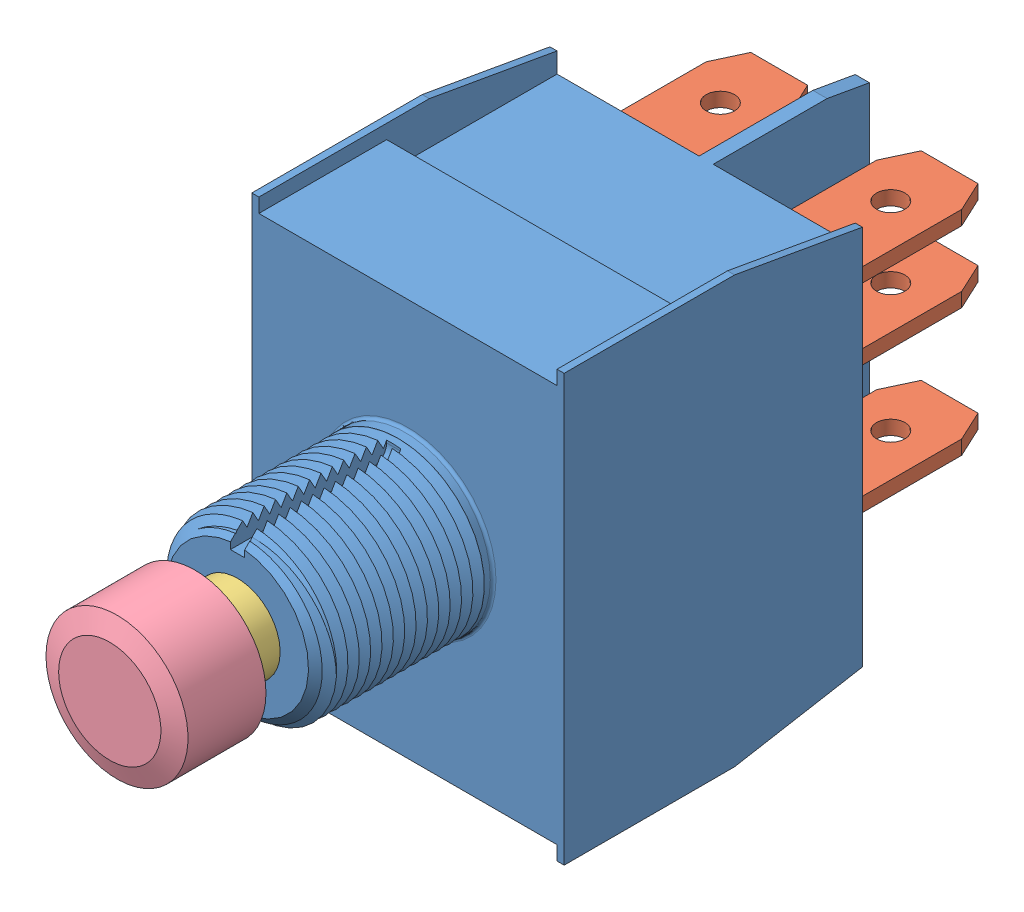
SolidWorks assembly PoussoirDD.SLDASM, configuration Défaut (file format 7000). Lengths in mm.
Overall size (22 30 53.14).
9 component instances, 4 part files, 22 mates.
Components (placement in the parent):
- PoussoirDD1-1: PoussoirDD1.SLDPRT [Défaut] at (0.8553 -0.3305 22.0048) size (22 30 44.01)
- PoussoirDD2-1: PoussoirDD2.SLDPRT [Défaut] at (-9.1447 8.6695 32.0048) x (1 0 0) z (0 -1 0) size (8 17.4 1)
- PoussoirDD2-2: PoussoirDD2.SLDPRT [Défaut] at (2.8553 8.6695 32.0048) x (1 0 0) z (0 -1 0) size (8 17.4 1)
- PoussoirDD2-3: PoussoirDD2.SLDPRT [Défaut] at (-9.1447 3.6695 32.0048) x (1 0 0) z (0 -1 0) size (8 17.4 1)
- PoussoirDD2-4: PoussoirDD2.SLDPRT [Défaut] at (2.8553 -5.3305 32.0048) x (1 0 0) z (0 -1 0) size (8 17.4 1)
- PoussoirDD2-5: PoussoirDD2.SLDPRT [Défaut] at (-9.1447 -5.3305 32.0048) x (1 0 0) z (0 -1 0) size (8 17.4 1)
- PoussoirDD2-6: PoussoirDD2.SLDPRT [Défaut] at (2.8553 3.6695 32.0048) x (1 0 0) z (0 -1 0) size (8 17.4 1)
- PoussoirDD6-1: PoussoirDD6.SLDPRT [Défaut] at (0.8553 -0.3305 74.0048) x (0 0 -1) z (0.736163 0.676805 0) size (20 6 6)
- PoussoirDD3-1: PoussoirDD3.SLDPRT [Défaut] at (0.8553 -0.3305 75.0048) x (0 0 -1) z (1 0 0) size (6 10 10)
Mates (geometry in assembly coordinates):
- Coïncidente1: coincident anti-aligned: plane of PoussoirDD1-1 through (-2.1447 8.6695 38.0048) normal (0 -1 0); plane of PoussoirDD2-1 through (-9.1447 8.6695 32.0048) normal (0 1 0)
- Coïncidente2: coincident anti-aligned: plane of PoussoirDD1-1 through (-2.1447 3.6695 38.0048) normal (0 -1 0); plane of PoussoirDD2-3 through (-9.1447 3.6695 32.0048) normal (0 1 0)
- Coïncidente3: coincident anti-aligned: plane of PoussoirDD1-1 through (-2.1447 -5.3305 38.0048) normal (0 -1 0); plane of PoussoirDD2-5 through (-9.1447 -5.3305 32.0048) normal (0 1 0)
- Coïncidente4: coincident anti-aligned: plane of PoussoirDD1-1 through (9.8553 8.6695 38.0048) normal (0 -1 0); plane of PoussoirDD2-2 through (2.8553 8.6695 32.0048) normal (0 1 0)
- Coïncidente5: coincident anti-aligned: plane of PoussoirDD1-1 through (9.8553 3.6695 38.0048) normal (0 -1 0); plane of PoussoirDD2-6 through (2.8553 3.6695 32.0048) normal (0 1 0)
- Coïncidente6: coincident anti-aligned: plane of PoussoirDD1-1 through (9.8553 -5.3305 38.0048) normal (0 -1 0); plane of PoussoirDD2-4 through (2.8553 -5.3305 32.0048) normal (0 1 0)
- Coïncidente7: coincident anti-aligned: plane of PoussoirDD1-1 through (-8.1447 -5.3305 38.0048) normal (1 0 0); plane of PoussoirDD2-5 through (-8.1447 -6.3305 33.0048) normal (-1 0 0)
- Coïncidente8: coincident anti-aligned: plane of PoussoirDD1-1 through (-2.1447 3.6695 38.0048) normal (-1 0 0); plane of PoussoirDD2-3 through (-2.1447 2.6695 39.2595) normal (1 0 0)
- Coïncidente9: coincident anti-aligned: plane of PoussoirDD1-1 through (-2.1447 8.6695 38.0048) normal (-1 0 0); plane of PoussoirDD2-1 through (-2.1447 7.6695 39.2595) normal (1 0 0)
- Coïncidente10: coincident anti-aligned: plane of PoussoirDD1-1 through (3.8553 -5.3305 38.0048) normal (1 0 0); plane of PoussoirDD2-4 through (3.8553 -6.3305 33.0048) normal (-1 0 0)
- Coïncidente11: coincident anti-aligned: plane of PoussoirDD1-1 through (3.8553 3.6695 38.0048) normal (1 0 0); plane of PoussoirDD2-6 through (3.8553 2.6695 33.0048) normal (-1 0 0)
- Coïncidente12: coincident anti-aligned: plane of PoussoirDD1-1 through (3.8553 8.6695 38.0048) normal (1 0 0); plane of PoussoirDD2-2 through (3.8553 7.6695 33.0048) normal (-1 0 0)
- Coïncidente13: coincident anti-aligned: plane of PoussoirDD1-1 through (0.8553 -0.3305 33.0048) normal (0 0 -1); plane of PoussoirDD2-1 through (-9.1447 7.6695 33.0048) normal (0 0 1)
- Coïncidente14: coincident anti-aligned: plane of PoussoirDD1-1 through (0.8553 -0.3305 33.0048) normal (0 0 -1); plane of PoussoirDD2-3 through (-9.1447 2.6695 33.0048) normal (0 0 1)
- Coïncidente15: coincident anti-aligned: plane of PoussoirDD1-1 through (0.8553 -0.3305 33.0048) normal (0 0 -1); plane of PoussoirDD2-5 through (-9.1447 -6.3305 33.0048) normal (0 0 1)
- Coïncidente16: coincident anti-aligned: plane of PoussoirDD1-1 through (0.8553 -0.3305 33.0048) normal (0 0 -1); plane of PoussoirDD2-4 through (9.8553 -6.3305 33.0048) normal (0 0 1)
- Coïncidente17: coincident anti-aligned: plane of PoussoirDD1-1 through (0.8553 -0.3305 33.0048) normal (0 0 -1); plane of PoussoirDD2-6 through (9.8553 2.6695 33.0048) normal (0 0 1)
- Coïncidente18: coincident anti-aligned: plane of PoussoirDD1-1 through (0.8553 -0.3305 33.0048) normal (0 0 -1); plane of PoussoirDD2-2 through (9.8553 7.6695 33.0048) normal (0 0 1)
- Coaxiale2: concentric anti-aligned: cylinder of PoussoirDD1-1 through (0.8553 -0.3305 66.0048) axis (0 0 -1) radius 3; cylinder of PoussoirDD6-1 through (0.8553 -0.3305 103.015) axis (0 0 1) radius 3
- Coïncidente19: coincident anti-aligned: plane of PoussoirDD1-1 through (0.8553 -0.3305 54.0048) normal (0 0 1); plane of PoussoirDD6-1 through (-1.1751 1.878 54.0048) normal (0 0 -1)
- Coaxiale3: concentric aligned: cylinder of PoussoirDD6-1 through (0.8553 -0.3305 103.015) axis (0 0 1) radius 3; cylinder of PoussoirDD3-1 through (0.8553 -0.3305 92.953) axis (0 0 1) radius 3
- Coïncidente20: coincident anti-aligned: plane of PoussoirDD6-1 through (0.8553 -0.3305 74.0048) normal (0 0 1); plane of PoussoirDD3-1 through (0.8553 2.6695 74.0048) normal (0 0 -1)
